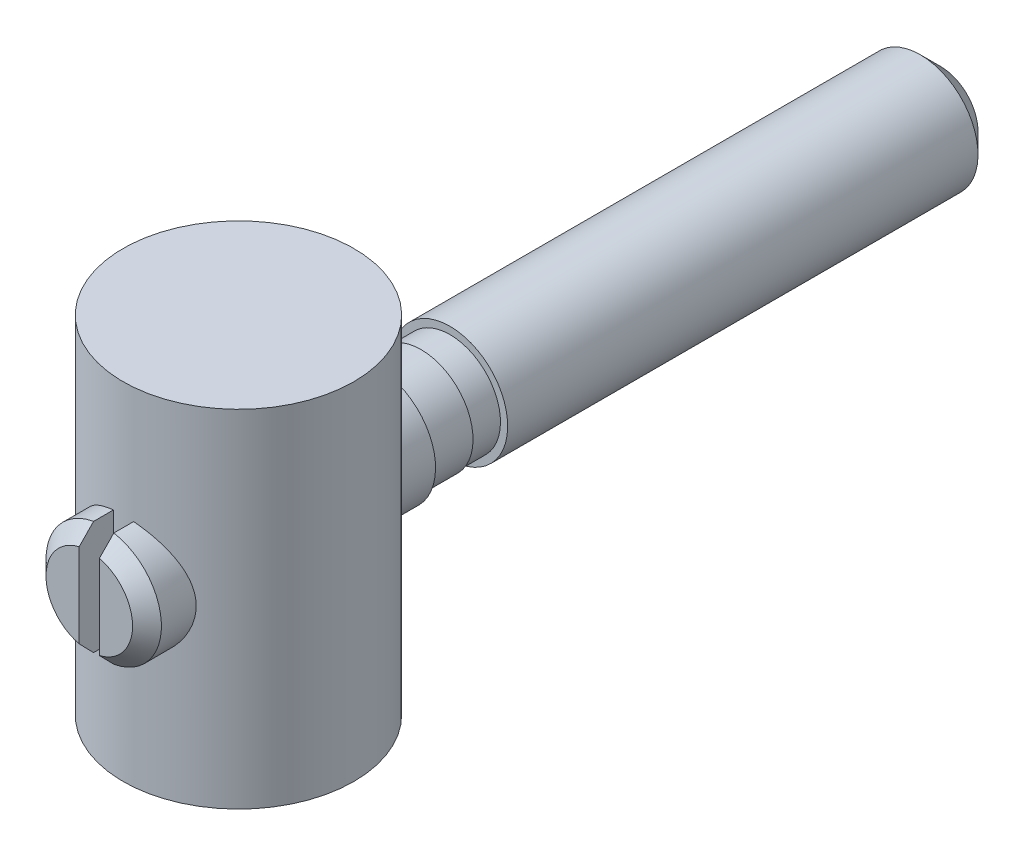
ISO-10303-21;
HEADER;
FILE_DESCRIPTION(('STEP AP214'),'2;1');
FILE_NAME('part.step','',(''),(''),'','','');
FILE_SCHEMA(('AUTOMOTIVE_DESIGN { 1 0 10303 214 1 1 1 1 }'));
ENDSEC;
DATA;
#1=APPLICATION_CONTEXT('core data for automotive mechanical design processes');
#2=APPLICATION_PROTOCOL_DEFINITION('international standard','automotive_design',2000,#1);
#3=PRODUCT_CONTEXT('',#1,'mechanical');
#4=PRODUCT('Part','Part','',(#3));
#5=PRODUCT_RELATED_PRODUCT_CATEGORY('part','',(#4));
#6=PRODUCT_DEFINITION_FORMATION('','',#4);
#7=PRODUCT_DEFINITION_CONTEXT('part definition',#1,'design');
#8=PRODUCT_DEFINITION('design','',#6,#7);
#9=PRODUCT_DEFINITION_SHAPE('','',#8);
#10=(LENGTH_UNIT() NAMED_UNIT(*) SI_UNIT(.MILLI.,.METRE.));
#11=(NAMED_UNIT(*) PLANE_ANGLE_UNIT() SI_UNIT($,.RADIAN.));
#12=(NAMED_UNIT(*) SI_UNIT($,.STERADIAN.) SOLID_ANGLE_UNIT());
#13=UNCERTAINTY_MEASURE_WITH_UNIT(LENGTH_MEASURE(1.E-05),#10,'distance_accuracy_value','');
#14=(GEOMETRIC_REPRESENTATION_CONTEXT(3) GLOBAL_UNCERTAINTY_ASSIGNED_CONTEXT((#13)) GLOBAL_UNIT_ASSIGNED_CONTEXT((#10,
#11,#12)) REPRESENTATION_CONTEXT('',''));
#15=CARTESIAN_POINT('',(0.,0.,0.));
#16=DIRECTION('',(0.,0.,1.));
#17=DIRECTION('',(1.,0.,0.));
#18=AXIS2_PLACEMENT_3D('',#15,#16,#17);
#19=CARTESIAN_POINT('',(0.,-6.,0.));
#20=DIRECTION('',(0.,-1.,0.));
#21=DIRECTION('',(1.,0.,0.));
#22=AXIS2_PLACEMENT_3D('',#19,#20,#21);
#23=PLANE('',#22);
#24=DIRECTION('',(0.5,0.,-0.866025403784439));
#25=VECTOR('',#24,1.);
#26=CARTESIAN_POINT('',(0.86602540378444,-6.,0.));
#27=LINE('',#26,#25);
#28=CARTESIAN_POINT('',(0.43301270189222,-6.,0.750000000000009));
#29=VERTEX_POINT('',#28);
#30=CARTESIAN_POINT('',(0.86602540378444,-6.,0.));
#31=VERTEX_POINT('',#30);
#32=EDGE_CURVE('E94',#29,#31,#27,.T.);
#33=ORIENTED_EDGE('',*,*,#32,.F.);
#34=DIRECTION('',(1.,0.,0.));
#35=VECTOR('',#34,1.);
#36=CARTESIAN_POINT('',(0.43301270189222,-6.,0.750000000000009));
#37=LINE('',#36,#35);
#38=CARTESIAN_POINT('',(-0.433012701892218,-6.,0.750000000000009));
#39=VERTEX_POINT('',#38);
#40=EDGE_CURVE('E92',#39,#29,#37,.T.);
#41=ORIENTED_EDGE('',*,*,#40,.F.);
#42=DIRECTION('',(0.5,0.,0.866025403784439));
#43=VECTOR('',#42,1.);
#44=CARTESIAN_POINT('',(-0.433012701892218,-6.,0.750000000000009));
#45=LINE('',#44,#43);
#46=CARTESIAN_POINT('',(-0.866025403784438,-6.,0.));
#47=VERTEX_POINT('',#46);
#48=EDGE_CURVE('E524',#47,#39,#45,.T.);
#49=ORIENTED_EDGE('',*,*,#48,.F.);
#50=DIRECTION('',(-0.5,0.,0.866025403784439));
#51=VECTOR('',#50,1.);
#52=CARTESIAN_POINT('',(-0.866025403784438,-6.,0.));
#53=LINE('',#52,#51);
#54=CARTESIAN_POINT('',(-0.433012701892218,-6.,-0.75));
#55=VERTEX_POINT('',#54);
#56=EDGE_CURVE('E574',#55,#47,#53,.T.);
#57=ORIENTED_EDGE('',*,*,#56,.F.);
#58=DIRECTION('',(-1.,0.,0.));
#59=VECTOR('',#58,1.);
#60=CARTESIAN_POINT('',(-0.433012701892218,-6.,-0.75));
#61=LINE('',#60,#59);
#62=CARTESIAN_POINT('',(0.433012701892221,-6.,-0.75));
#63=VERTEX_POINT('',#62);
#64=EDGE_CURVE('E535',#63,#55,#61,.T.);
#65=ORIENTED_EDGE('',*,*,#64,.F.);
#66=DIRECTION('',(-0.5,0.,-0.866025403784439));
#67=VECTOR('',#66,1.);
#68=CARTESIAN_POINT('',(0.433012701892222,-6.,-0.75));
#69=LINE('',#68,#67);
#70=EDGE_CURVE('E522',#31,#63,#69,.T.);
#71=ORIENTED_EDGE('',*,*,#70,.F.);
#72=EDGE_LOOP('',(#33,#41,#49,#57,#65,#71));
#73=FACE_BOUND('',#72,.T.);
#74=ADVANCED_FACE('F14',(#73),#23,.T.);
#75=CARTESIAN_POINT('',(0.433012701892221,-5.8,-0.75));
#76=DIRECTION('',(0.866025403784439,0.,-0.5));
#77=DIRECTION('',(-0.5,0.,-0.866025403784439));
#78=AXIS2_PLACEMENT_3D('',#75,#76,#77);
#79=PLANE('',#78);
#80=DIRECTION('',(0.,1.,0.));
#81=VECTOR('',#80,1.);
#82=CARTESIAN_POINT('',(0.86602540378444,-5.8,0.));
#83=LINE('',#82,#81);
#84=CARTESIAN_POINT('',(0.86602540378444,-7.,0.));
#85=VERTEX_POINT('',#84);
#86=EDGE_CURVE('E80',#31,#85,#83,.F.);
#87=ORIENTED_EDGE('',*,*,#86,.F.);
#88=ORIENTED_EDGE('',*,*,#70,.T.);
#89=DIRECTION('',(0.,1.,0.));
#90=VECTOR('',#89,1.);
#91=CARTESIAN_POINT('',(0.433012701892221,-5.8,-0.75));
#92=LINE('',#91,#90);
#93=CARTESIAN_POINT('',(0.433012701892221,-7.,-0.75));
#94=VERTEX_POINT('',#93);
#95=EDGE_CURVE('E107',#94,#63,#92,.T.);
#96=ORIENTED_EDGE('',*,*,#95,.F.);
#97=DIRECTION('',(0.5,0.,0.866025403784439));
#98=VECTOR('',#97,1.);
#99=CARTESIAN_POINT('',(0.433012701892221,-7.,-0.75));
#100=LINE('',#99,#98);
#101=EDGE_CURVE('E130',#94,#85,#100,.T.);
#102=ORIENTED_EDGE('',*,*,#101,.T.);
#103=EDGE_LOOP('',(#87,#88,#96,#102));
#104=FACE_BOUND('',#103,.T.);
#105=ADVANCED_FACE('F165',(#104),#79,.F.);
#106=CARTESIAN_POINT('',(0.86602540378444,-5.8,0.));
#107=DIRECTION('',(0.866025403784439,0.,0.5));
#108=DIRECTION('',(0.5,0.,-0.866025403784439));
#109=AXIS2_PLACEMENT_3D('',#106,#107,#108);
#110=PLANE('',#109);
#111=DIRECTION('',(0.,1.,0.));
#112=VECTOR('',#111,1.);
#113=CARTESIAN_POINT('',(0.43301270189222,-5.8,0.750000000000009));
#114=LINE('',#113,#112);
#115=CARTESIAN_POINT('',(0.43301270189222,-7.,0.750000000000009));
#116=VERTEX_POINT('',#115);
#117=EDGE_CURVE('E78',#116,#29,#114,.T.);
#118=ORIENTED_EDGE('',*,*,#117,.T.);
#119=ORIENTED_EDGE('',*,*,#32,.T.);
#120=ORIENTED_EDGE('',*,*,#86,.T.);
#121=DIRECTION('',(-0.5,0.,0.866025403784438));
#122=VECTOR('',#121,1.);
#123=CARTESIAN_POINT('',(0.86602540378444,-7.,0.));
#124=LINE('',#123,#122);
#125=EDGE_CURVE('E75',#85,#116,#124,.T.);
#126=ORIENTED_EDGE('',*,*,#125,.T.);
#127=EDGE_LOOP('',(#118,#119,#120,#126));
#128=FACE_BOUND('',#127,.T.);
#129=ADVANCED_FACE('F16',(#128),#110,.F.);
#130=CARTESIAN_POINT('',(0.43301270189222,-5.8,0.750000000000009));
#131=DIRECTION('',(0.,0.,1.));
#132=DIRECTION('',(1.,0.,0.));
#133=AXIS2_PLACEMENT_3D('',#130,#131,#132);
#134=PLANE('',#133);
#135=DIRECTION('',(0.,1.,0.));
#136=VECTOR('',#135,1.);
#137=CARTESIAN_POINT('',(-0.433012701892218,-5.8,0.750000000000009));
#138=LINE('',#137,#136);
#139=CARTESIAN_POINT('',(-0.433012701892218,-7.,0.750000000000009));
#140=VERTEX_POINT('',#139);
#141=EDGE_CURVE('E93',#140,#39,#138,.T.);
#142=ORIENTED_EDGE('',*,*,#141,.T.);
#143=ORIENTED_EDGE('',*,*,#40,.T.);
#144=ORIENTED_EDGE('',*,*,#117,.F.);
#145=DIRECTION('',(-1.,0.,0.));
#146=VECTOR('',#145,1.);
#147=CARTESIAN_POINT('',(0.,-7.,0.750000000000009));
#148=LINE('',#147,#146);
#149=EDGE_CURVE('E85',#116,#140,#148,.T.);
#150=ORIENTED_EDGE('',*,*,#149,.T.);
#151=EDGE_LOOP('',(#142,#143,#144,#150));
#152=FACE_BOUND('',#151,.T.);
#153=ADVANCED_FACE('F90',(#152),#134,.F.);
#154=CARTESIAN_POINT('',(-0.433012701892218,-5.8,0.750000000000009));
#155=DIRECTION('',(-0.866025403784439,0.,0.5));
#156=DIRECTION('',(0.5,0.,0.866025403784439));
#157=AXIS2_PLACEMENT_3D('',#154,#155,#156);
#158=PLANE('',#157);
#159=DIRECTION('',(0.,1.,0.));
#160=VECTOR('',#159,1.);
#161=CARTESIAN_POINT('',(-0.866025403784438,-5.8,0.));
#162=LINE('',#161,#160);
#163=CARTESIAN_POINT('',(-0.866025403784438,-7.,0.));
#164=VERTEX_POINT('',#163);
#165=EDGE_CURVE('E113',#164,#47,#162,.T.);
#166=ORIENTED_EDGE('',*,*,#165,.T.);
#167=ORIENTED_EDGE('',*,*,#48,.T.);
#168=ORIENTED_EDGE('',*,*,#141,.F.);
#169=DIRECTION('',(-0.5,0.,-0.866025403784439));
#170=VECTOR('',#169,1.);
#171=CARTESIAN_POINT('',(-0.433012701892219,-7.,0.750000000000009));
#172=LINE('',#171,#170);
#173=EDGE_CURVE('E100',#140,#164,#172,.T.);
#174=ORIENTED_EDGE('',*,*,#173,.T.);
#175=EDGE_LOOP('',(#166,#167,#168,#174));
#176=FACE_BOUND('',#175,.T.);
#177=ADVANCED_FACE('F175',(#176),#158,.F.);
#178=CARTESIAN_POINT('',(-0.866025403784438,-5.8,0.));
#179=DIRECTION('',(-0.866025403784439,0.,-0.5));
#180=DIRECTION('',(-0.5,0.,0.866025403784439));
#181=AXIS2_PLACEMENT_3D('',#178,#179,#180);
#182=PLANE('',#181);
#183=DIRECTION('',(0.,1.,0.));
#184=VECTOR('',#183,1.);
#185=CARTESIAN_POINT('',(-0.433012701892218,-5.8,-0.75));
#186=LINE('',#185,#184);
#187=CARTESIAN_POINT('',(-0.433012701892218,-7.,-0.75));
#188=VERTEX_POINT('',#187);
#189=EDGE_CURVE('E110',#188,#55,#186,.T.);
#190=ORIENTED_EDGE('',*,*,#189,.T.);
#191=ORIENTED_EDGE('',*,*,#56,.T.);
#192=ORIENTED_EDGE('',*,*,#165,.F.);
#193=DIRECTION('',(0.5,0.,-0.866025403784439));
#194=VECTOR('',#193,1.);
#195=CARTESIAN_POINT('',(-0.866025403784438,-7.,0.));
#196=LINE('',#195,#194);
#197=EDGE_CURVE('E102',#164,#188,#196,.T.);
#198=ORIENTED_EDGE('',*,*,#197,.T.);
#199=EDGE_LOOP('',(#190,#191,#192,#198));
#200=FACE_BOUND('',#199,.T.);
#201=ADVANCED_FACE('F171',(#200),#182,.F.);
#202=CARTESIAN_POINT('',(-0.433012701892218,-5.8,-0.75));
#203=DIRECTION('',(0.,0.,-1.));
#204=DIRECTION('',(-1.,0.,0.));
#205=AXIS2_PLACEMENT_3D('',#202,#203,#204);
#206=PLANE('',#205);
#207=ORIENTED_EDGE('',*,*,#95,.T.);
#208=ORIENTED_EDGE('',*,*,#64,.T.);
#209=ORIENTED_EDGE('',*,*,#189,.F.);
#210=DIRECTION('',(-1.,0.,0.));
#211=VECTOR('',#210,1.);
#212=CARTESIAN_POINT('',(0.,-7.,-0.75));
#213=LINE('',#212,#211);
#214=EDGE_CURVE('E529',#188,#94,#213,.F.);
#215=ORIENTED_EDGE('',*,*,#214,.T.);
#216=EDGE_LOOP('',(#207,#208,#209,#215));
#217=FACE_BOUND('',#216,.T.);
#218=ADVANCED_FACE('F163',(#217),#206,.F.);
#219=CARTESIAN_POINT('',(0.,-7.,0.));
#220=DIRECTION('',(0.,1.,0.));
#221=DIRECTION('',(-1.,0.,0.));
#222=AXIS2_PLACEMENT_3D('',#219,#220,#221);
#223=PLANE('',#222);
#224=CARTESIAN_POINT('',(0.,-7.,0.));
#225=DIRECTION('',(0.,1.,0.));
#226=DIRECTION('',(-1.,0.,0.));
#227=AXIS2_PLACEMENT_3D('',#224,#225,#226);
#228=CIRCLE('',#227,1.5);
#229=CARTESIAN_POINT('',(-1.5,-7.,0.));
#230=VERTEX_POINT('',#229);
#231=EDGE_CURVE('E127',#230,#230,#228,.T.);
#232=ORIENTED_EDGE('',*,*,#231,.F.);
#233=EDGE_LOOP('',(#232));
#234=FACE_BOUND('',#233,.T.);
#235=ORIENTED_EDGE('',*,*,#214,.F.);
#236=ORIENTED_EDGE('',*,*,#197,.F.);
#237=ORIENTED_EDGE('',*,*,#173,.F.);
#238=ORIENTED_EDGE('',*,*,#149,.F.);
#239=ORIENTED_EDGE('',*,*,#125,.F.);
#240=ORIENTED_EDGE('',*,*,#101,.F.);
#241=EDGE_LOOP('',(#235,#236,#237,#238,#239,#240));
#242=FACE_BOUND('',#241,.T.);
#243=ADVANCED_FACE('F98',(#234,#242),#223,.F.);
#244=CARTESIAN_POINT('',(0.,-4.,0.));
#245=DIRECTION('',(0.,1.,0.));
#246=DIRECTION('',(-1.,0.,0.));
#247=AXIS2_PLACEMENT_3D('',#244,#245,#246);
#248=CYLINDRICAL_SURFACE('',#247,1.5);
#249=ORIENTED_EDGE('',*,*,#231,.T.);
#250=EDGE_LOOP('',(#249));
#251=FACE_BOUND('',#250,.T.);
#252=CARTESIAN_POINT('',(0.,-6.,0.));
#253=DIRECTION('',(0.,1.,0.));
#254=DIRECTION('',(-1.,0.,0.));
#255=AXIS2_PLACEMENT_3D('',#252,#253,#254);
#256=CIRCLE('',#255,1.5);
#257=CARTESIAN_POINT('',(-1.5,-6.,0.));
#258=VERTEX_POINT('',#257);
#259=EDGE_CURVE('E124',#258,#258,#256,.F.);
#260=ORIENTED_EDGE('',*,*,#259,.T.);
#261=EDGE_LOOP('',(#260));
#262=FACE_BOUND('',#261,.T.);
#263=ADVANCED_FACE('F156',(#251,#262),#248,.T.);
#264=CARTESIAN_POINT('',(0.,6.,0.));
#265=DIRECTION('',(0.,1.,0.));
#266=DIRECTION('',(-1.,0.,0.));
#267=AXIS2_PLACEMENT_3D('',#264,#265,#266);
#268=PLANE('',#267);
#269=CARTESIAN_POINT('',(0.,6.,0.));
#270=DIRECTION('',(0.,-1.,0.));
#271=DIRECTION('',(1.,0.,0.));
#272=AXIS2_PLACEMENT_3D('',#269,#270,#271);
#273=CIRCLE('',#272,4.);
#274=CARTESIAN_POINT('',(4.,6.,0.));
#275=VERTEX_POINT('',#274);
#276=EDGE_CURVE('E121',#275,#275,#273,.T.);
#277=ORIENTED_EDGE('',*,*,#276,.F.);
#278=EDGE_LOOP('',(#277));
#279=FACE_BOUND('',#278,.T.);
#280=ADVANCED_FACE('F152',(#279),#268,.T.);
#281=CARTESIAN_POINT('',(0.,-6.,0.));
#282=DIRECTION('',(0.,1.,0.));
#283=DIRECTION('',(-1.,0.,0.));
#284=AXIS2_PLACEMENT_3D('',#281,#282,#283);
#285=PLANE('',#284);
#286=ORIENTED_EDGE('',*,*,#259,.F.);
#287=EDGE_LOOP('',(#286));
#288=FACE_BOUND('',#287,.T.);
#289=CARTESIAN_POINT('',(0.,-6.,0.));
#290=DIRECTION('',(0.,-1.,0.));
#291=DIRECTION('',(1.,0.,0.));
#292=AXIS2_PLACEMENT_3D('',#289,#290,#291);
#293=CIRCLE('',#292,4.);
#294=CARTESIAN_POINT('',(4.,-6.,0.));
#295=VERTEX_POINT('',#294);
#296=EDGE_CURVE('E117',#295,#295,#293,.F.);
#297=ORIENTED_EDGE('',*,*,#296,.F.);
#298=EDGE_LOOP('',(#297));
#299=FACE_BOUND('',#298,.T.);
#300=ADVANCED_FACE('F146',(#288,#299),#285,.F.);
#301=CARTESIAN_POINT('',(0.,6.,0.));
#302=DIRECTION('',(0.,-1.,0.));
#303=DIRECTION('',(1.,0.,0.));
#304=AXIS2_PLACEMENT_3D('',#301,#302,#303);
#305=CYLINDRICAL_SURFACE('',#304,4.);
#306=CARTESIAN_POINT('',(0.,2.,4.));
#307=CARTESIAN_POINT('',(-0.105143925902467,1.99999339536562,3.99999426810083));
#308=CARTESIAN_POINT('',(-0.210413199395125,1.99165985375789,3.99580982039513));
#309=CARTESIAN_POINT('',(-0.417840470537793,1.95869423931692,3.97948312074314));
#310=CARTESIAN_POINT('',(-0.519992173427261,1.93403121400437,3.9673257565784));
#311=CARTESIAN_POINT('',(-0.7178670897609,1.86961238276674,3.93632558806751));
#312=CARTESIAN_POINT('',(-0.813613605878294,1.82991523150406,3.91750878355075));
#313=CARTESIAN_POINT('',(-0.996945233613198,1.73685875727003,3.87491553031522));
#314=CARTESIAN_POINT('',(-1.08453098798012,1.68350051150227,3.8511394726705));
#315=CARTESIAN_POINT('',(-1.25501563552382,1.56096550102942,3.79912516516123));
#316=CARTESIAN_POINT('',(-1.33731042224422,1.49102704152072,3.77070398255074));
#317=CARTESIAN_POINT('',(-1.48955888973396,1.33895704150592,3.71319940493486));
#318=CARTESIAN_POINT('',(-1.55950316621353,1.25681629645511,3.68411552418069));
#319=CARTESIAN_POINT('',(-1.69050400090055,1.07503330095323,3.62597902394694));
#320=CARTESIAN_POINT('',(-1.75045067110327,0.97452780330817,3.59710373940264));
#321=CARTESIAN_POINT('',(-1.85233645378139,0.763265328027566,3.54571957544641));
#322=CARTESIAN_POINT('',(-1.89428842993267,0.652515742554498,3.52320615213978));
#323=CARTESIAN_POINT('',(-1.95626488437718,0.430669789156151,3.48915734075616));
#324=CARTESIAN_POINT('',(-1.97745171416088,0.319991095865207,3.47704543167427));
#325=CARTESIAN_POINT('',(-2.00085398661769,0.0960423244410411,3.46363779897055));
#326=CARTESIAN_POINT('',(-2.00308817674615,-0.0172250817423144,3.46233138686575));
#327=CARTESIAN_POINT('',(-1.98937457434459,-0.228572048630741,3.47021860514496));
#328=CARTESIAN_POINT('',(-1.97556911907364,-0.326848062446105,3.47817527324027));
#329=CARTESIAN_POINT('',(-1.93387969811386,-0.519443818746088,3.50152457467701));
#330=CARTESIAN_POINT('',(-1.9059912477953,-0.613762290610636,3.51691957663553));
#331=CARTESIAN_POINT('',(-1.83641956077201,-0.798458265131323,3.55374952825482));
#332=CARTESIAN_POINT('',(-1.79443013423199,-0.888692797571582,3.57531681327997));
#333=CARTESIAN_POINT('',(-1.69808337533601,-1.06126858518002,3.62206808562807));
#334=CARTESIAN_POINT('',(-1.64372048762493,-1.14360627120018,3.64725369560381));
#335=CARTESIAN_POINT('',(-1.51613210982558,-1.30904250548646,3.70226315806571));
#336=CARTESIAN_POINT('',(-1.44138891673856,-1.39091374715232,3.73227020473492));
#337=CARTESIAN_POINT('',(-1.27911115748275,-1.54147083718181,3.79095246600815));
#338=CARTESIAN_POINT('',(-1.19157051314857,-1.61015038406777,3.81962703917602));
#339=CARTESIAN_POINT('',(-1.0010330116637,-1.73537132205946,3.87403974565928));
#340=CARTESIAN_POINT('',(-0.897507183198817,-1.79120094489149,3.89957968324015));
#341=CARTESIAN_POINT('',(-0.680932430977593,-1.88419405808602,3.94315762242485));
#342=CARTESIAN_POINT('',(-0.567891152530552,-1.92137237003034,3.96120157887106));
#343=CARTESIAN_POINT('',(-0.345532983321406,-1.97295080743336,3.98648667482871));
#344=CARTESIAN_POINT('',(-0.236683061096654,-1.98898247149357,3.9944987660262));
#345=CARTESIAN_POINT('',(-0.0175591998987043,-2.00292946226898,4.00146026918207));
#346=CARTESIAN_POINT('',(0.0927140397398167,-2.00085337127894,4.00041397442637));
#347=CARTESIAN_POINT('',(0.302465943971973,-1.97958662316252,3.98982384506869));
#348=CARTESIAN_POINT('',(0.402118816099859,-1.96173493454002,3.98094491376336));
#349=CARTESIAN_POINT('',(0.596813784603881,-1.91152385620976,3.95644342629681));
#350=CARTESIAN_POINT('',(0.691855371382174,-1.87916286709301,3.94082012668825));
#351=CARTESIAN_POINT('',(0.877777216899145,-1.80000306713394,3.90368502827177));
#352=CARTESIAN_POINT('',(0.968460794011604,-1.75281789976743,3.88201763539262));
#353=CARTESIAN_POINT('',(1.14092272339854,-1.64578492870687,3.83487948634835));
#354=CARTESIAN_POINT('',(1.22269725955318,-1.58593173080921,3.80940711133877));
#355=CARTESIAN_POINT('',(1.38353537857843,-1.44847914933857,3.75416442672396));
#356=CARTESIAN_POINT('',(1.46154415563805,-1.36971426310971,3.72421769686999));
#357=CARTESIAN_POINT('',(1.60371264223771,-1.20014969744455,3.66524783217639));
#358=CARTESIAN_POINT('',(1.66786277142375,-1.10934176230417,3.63622534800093));
#359=CARTESIAN_POINT('',(1.78341582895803,-0.912712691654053,3.58102384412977));
#360=CARTESIAN_POINT('',(1.8340509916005,-0.806377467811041,3.55505059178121));
#361=CARTESIAN_POINT('',(1.91616565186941,-0.584979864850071,3.5114814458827));
#362=CARTESIAN_POINT('',(1.94766983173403,-0.469928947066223,3.493874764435));
#363=CARTESIAN_POINT('',(1.98772337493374,-0.246179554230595,3.47123002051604));
#364=CARTESIAN_POINT('',(1.9981859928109,-0.13793149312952,3.4651476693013));
#365=CARTESIAN_POINT('',(2.0013783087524,0.0788941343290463,3.46330709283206));
#366=CARTESIAN_POINT('',(1.99411569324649,0.18747153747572,3.46754439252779));
#367=CARTESIAN_POINT('',(1.96385225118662,0.39096700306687,3.48475724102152));
#368=CARTESIAN_POINT('',(1.94241662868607,0.486200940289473,3.49686188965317));
#369=CARTESIAN_POINT('',(1.88635071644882,0.671616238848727,3.52742032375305));
#370=CARTESIAN_POINT('',(1.85171618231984,0.761795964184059,3.54587615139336));
#371=CARTESIAN_POINT('',(1.76763149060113,0.94124970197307,3.5885706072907));
#372=CARTESIAN_POINT('',(1.7173422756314,1.03005580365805,3.61311444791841));
#373=CARTESIAN_POINT('',(1.60430194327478,1.19854907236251,3.66470663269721));
#374=CARTESIAN_POINT('',(1.54154434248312,1.27823146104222,3.69175627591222));
#375=CARTESIAN_POINT('',(1.39640665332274,1.43628396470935,3.74924646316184));
#376=CARTESIAN_POINT('',(1.31256884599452,1.51331820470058,3.77969966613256));
#377=CARTESIAN_POINT('',(1.13230961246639,1.65252596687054,3.83755504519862));
#378=CARTESIAN_POINT('',(1.03588144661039,1.71469147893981,3.86495557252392));
#379=CARTESIAN_POINT('',(0.831863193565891,1.82247272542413,3.91396019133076));
#380=CARTESIAN_POINT('',(0.724199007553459,1.86796833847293,3.93552192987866));
#381=CARTESIAN_POINT('',(0.501484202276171,1.93961633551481,3.97002682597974));
#382=CARTESIAN_POINT('',(0.3864555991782,1.96582369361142,3.98299446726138));
#383=CARTESIAN_POINT('',(0.22520389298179,1.98779482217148,3.99390923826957));
#384=CARTESIAN_POINT('',(0.180323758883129,1.99236528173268,3.99618730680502));
#385=CARTESIAN_POINT('',(0.0903034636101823,1.99846933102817,3.99923393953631));
#386=CARTESIAN_POINT('',(0.0451632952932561,2.00000283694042,4.00000246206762));
#387=CARTESIAN_POINT('',(0.,2.,4.));
#388=B_SPLINE_CURVE_WITH_KNOTS('',3,(#306,#307,#308,#309,#310,#311,#312,#313,#314,#315,#316,
#317,#318,#319,#320,#321,#322,#323,#324,#325,#326,#327,#328,#329,#330,#331,#332,#333,#334,#335,
#336,#337,#338,#339,#340,#341,#342,#343,#344,#345,#346,#347,#348,#349,#350,#351,#352,#353,#354,
#355,#356,#357,#358,#359,#360,#361,#362,#363,#364,#365,#366,#367,#368,#369,#370,#371,#372,#373,
#374,#375,#376,#377,#378,#379,#380,#381,#382,#383,#384,#385,#386,#387),.UNSPECIFIED.,.T.,.F.,(4,
2,2,2,2,2,2,2,2,2,2,2,2,2,2,2,2,2,2,2,2,2,2,2,2,2,2,2,2,2,2,2,2,2,2,2,2,2,2,2,4),(0.,
0.315248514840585,0.631096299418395,0.945724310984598,1.26032752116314,1.59396351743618,
1.92785247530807,2.28763452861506,2.64715895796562,2.98516024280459,3.32282714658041,
3.62011424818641,3.91749607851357,4.22180480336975,4.52625042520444,4.86929882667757,
5.21251069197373,5.57166044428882,5.93052433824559,6.25966580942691,6.58865129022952,
6.89213813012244,7.19565843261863,7.50785712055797,7.82018901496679,8.16319221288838,
8.50643177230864,8.86629364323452,9.22569023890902,9.55058615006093,9.87534119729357,
10.1691586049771,10.463070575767,10.7767291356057,11.0905512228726,11.4425048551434,
11.7946476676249,12.1492802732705,12.502898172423,12.6383056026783,12.7737167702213),.UNSPECIFIED.);
#389=CARTESIAN_POINT('',(0.35,-1.96913686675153,3.98465807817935));
#390=VERTEX_POINT('',#389);
#391=CARTESIAN_POINT('',(0.35,1.96913686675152,3.98465807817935));
#392=VERTEX_POINT('',#391);
#393=EDGE_CURVE('E35',#390,#392,#388,.T.);
#394=ORIENTED_EDGE('',*,*,#393,.F.);
#395=DIRECTION('',(0.,-1.,0.));
#396=VECTOR('',#395,1.);
#397=CARTESIAN_POINT('',(0.35,6.,3.98465807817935));
#398=LINE('',#397,#396);
#399=EDGE_CURVE('E135',#392,#390,#398,.T.);
#400=ORIENTED_EDGE('',*,*,#399,.F.);
#401=EDGE_LOOP('',(#394,#400));
#402=FACE_BOUND('',#401,.T.);
#403=ORIENTED_EDGE('',*,*,#296,.T.);
#404=EDGE_LOOP('',(#403));
#405=FACE_BOUND('',#404,.T.);
#406=ORIENTED_EDGE('',*,*,#276,.T.);
#407=EDGE_LOOP('',(#406));
#408=FACE_BOUND('',#407,.T.);
#409=CARTESIAN_POINT('',(-0.35,1.96913686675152,3.98465807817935));
#410=VERTEX_POINT('',#409);
#411=CARTESIAN_POINT('',(-0.35,-1.96913686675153,3.98465807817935));
#412=VERTEX_POINT('',#411);
#413=EDGE_CURVE('E28',#410,#412,#388,.T.);
#414=ORIENTED_EDGE('',*,*,#413,.F.);
#415=DIRECTION('',(0.,-1.,0.));
#416=VECTOR('',#415,1.);
#417=CARTESIAN_POINT('',(-0.35,6.,3.98465807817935));
#418=LINE('',#417,#416);
#419=EDGE_CURVE('E559',#412,#410,#418,.F.);
#420=ORIENTED_EDGE('',*,*,#419,.F.);
#421=EDGE_LOOP('',(#414,#420));
#422=FACE_BOUND('',#421,.T.);
#423=CARTESIAN_POINT('',(0.,2.,-4.));
#424=CARTESIAN_POINT('',(0.105143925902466,1.99999339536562,-3.99999426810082));
#425=CARTESIAN_POINT('',(0.210413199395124,1.99165985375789,-3.99580982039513));
#426=CARTESIAN_POINT('',(0.417840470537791,1.95869423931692,-3.97948312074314));
#427=CARTESIAN_POINT('',(0.519992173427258,1.93403121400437,-3.96732575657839));
#428=CARTESIAN_POINT('',(0.717867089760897,1.86961238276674,-3.9363255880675));
#429=CARTESIAN_POINT('',(0.813613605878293,1.82991523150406,-3.91750878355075));
#430=CARTESIAN_POINT('',(0.996945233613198,1.73685875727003,-3.87491553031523));
#431=CARTESIAN_POINT('',(1.08453098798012,1.68350051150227,-3.85113947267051));
#432=CARTESIAN_POINT('',(1.25501563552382,1.56096550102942,-3.79912516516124));
#433=CARTESIAN_POINT('',(1.33731042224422,1.49102704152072,-3.77070398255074));
#434=CARTESIAN_POINT('',(1.48955888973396,1.33895704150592,-3.71319940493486));
#435=CARTESIAN_POINT('',(1.55950316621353,1.25681629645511,-3.68411552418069));
#436=CARTESIAN_POINT('',(1.69050400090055,1.07503330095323,-3.62597902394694));
#437=CARTESIAN_POINT('',(1.75045067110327,0.97452780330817,-3.59710373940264));
#438=CARTESIAN_POINT('',(1.85233645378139,0.763265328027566,-3.54571957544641));
#439=CARTESIAN_POINT('',(1.89428842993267,0.652515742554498,-3.52320615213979));
#440=CARTESIAN_POINT('',(1.95626488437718,0.430669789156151,-3.48915734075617));
#441=CARTESIAN_POINT('',(1.97745171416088,0.319991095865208,-3.47704543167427));
#442=CARTESIAN_POINT('',(2.00085398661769,0.0960423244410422,-3.46363779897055));
#443=CARTESIAN_POINT('',(2.00308817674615,-0.0172250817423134,-3.46233138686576));
#444=CARTESIAN_POINT('',(1.98937457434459,-0.22857204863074,-3.47021860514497));
#445=CARTESIAN_POINT('',(1.97556911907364,-0.326848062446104,-3.47817527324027));
#446=CARTESIAN_POINT('',(1.93387969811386,-0.519443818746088,-3.50152457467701));
#447=CARTESIAN_POINT('',(1.9059912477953,-0.613762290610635,-3.51691957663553));
#448=CARTESIAN_POINT('',(1.83641956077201,-0.798458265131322,-3.55374952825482));
#449=CARTESIAN_POINT('',(1.79443013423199,-0.888692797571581,-3.57531681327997));
#450=CARTESIAN_POINT('',(1.698083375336,-1.06126858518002,-3.62206808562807));
#451=CARTESIAN_POINT('',(1.64372048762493,-1.14360627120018,-3.64725369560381));
#452=CARTESIAN_POINT('',(1.51613210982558,-1.30904250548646,-3.70226315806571));
#453=CARTESIAN_POINT('',(1.44138891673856,-1.39091374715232,-3.73227020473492));
#454=CARTESIAN_POINT('',(1.27911115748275,-1.54147083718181,-3.79095246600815));
#455=CARTESIAN_POINT('',(1.19157051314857,-1.61015038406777,-3.81962703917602));
#456=CARTESIAN_POINT('',(1.0010330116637,-1.73537132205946,-3.87403974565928));
#457=CARTESIAN_POINT('',(0.897507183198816,-1.79120094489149,-3.89957968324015));
#458=CARTESIAN_POINT('',(0.680932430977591,-1.88419405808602,-3.94315762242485));
#459=CARTESIAN_POINT('',(0.56789115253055,-1.92137237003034,-3.96120157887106));
#460=CARTESIAN_POINT('',(0.345532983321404,-1.97295080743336,-3.98648667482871));
#461=CARTESIAN_POINT('',(0.236683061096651,-1.98898247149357,-3.9944987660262));
#462=CARTESIAN_POINT('',(0.0175591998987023,-2.00292946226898,-4.00146026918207));
#463=CARTESIAN_POINT('',(-0.0927140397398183,-2.00085337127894,-4.00041397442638));
#464=CARTESIAN_POINT('',(-0.302465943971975,-1.97958662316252,-3.9898238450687));
#465=CARTESIAN_POINT('',(-0.402118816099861,-1.96173493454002,-3.98094491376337));
#466=CARTESIAN_POINT('',(-0.596813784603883,-1.91152385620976,-3.95644342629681));
#467=CARTESIAN_POINT('',(-0.691855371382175,-1.87916286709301,-3.94082012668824));
#468=CARTESIAN_POINT('',(-0.877777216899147,-1.80000306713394,-3.90368502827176));
#469=CARTESIAN_POINT('',(-0.968460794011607,-1.75281789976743,-3.88201763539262));
#470=CARTESIAN_POINT('',(-1.14092272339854,-1.64578492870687,-3.83487948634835));
#471=CARTESIAN_POINT('',(-1.22269725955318,-1.58593173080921,-3.80940711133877));
#472=CARTESIAN_POINT('',(-1.38353537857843,-1.44847914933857,-3.75416442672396));
#473=CARTESIAN_POINT('',(-1.46154415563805,-1.36971426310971,-3.72421769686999));
#474=CARTESIAN_POINT('',(-1.60371264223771,-1.20014969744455,-3.6652478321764));
#475=CARTESIAN_POINT('',(-1.66786277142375,-1.10934176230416,-3.63622534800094));
#476=CARTESIAN_POINT('',(-1.78341582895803,-0.912712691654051,-3.58102384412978));
#477=CARTESIAN_POINT('',(-1.8340509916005,-0.80637746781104,-3.55505059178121));
#478=CARTESIAN_POINT('',(-1.91616565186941,-0.584979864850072,-3.5114814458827));
#479=CARTESIAN_POINT('',(-1.94766983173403,-0.469928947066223,-3.493874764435));
#480=CARTESIAN_POINT('',(-1.98772337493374,-0.246179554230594,-3.47123002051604));
#481=CARTESIAN_POINT('',(-1.9981859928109,-0.137931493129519,-3.4651476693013));
#482=CARTESIAN_POINT('',(-2.00137830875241,0.0788941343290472,-3.46330709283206));
#483=CARTESIAN_POINT('',(-1.99411569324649,0.18747153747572,-3.4675443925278));
#484=CARTESIAN_POINT('',(-1.96385225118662,0.390967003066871,-3.48475724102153));
#485=CARTESIAN_POINT('',(-1.94241662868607,0.486200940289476,-3.49686188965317));
#486=CARTESIAN_POINT('',(-1.88635071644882,0.67161623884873,-3.52742032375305));
#487=CARTESIAN_POINT('',(-1.85171618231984,0.761795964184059,-3.54587615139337));
#488=CARTESIAN_POINT('',(-1.76763149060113,0.94124970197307,-3.58857060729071));
#489=CARTESIAN_POINT('',(-1.7173422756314,1.03005580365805,-3.61311444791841));
#490=CARTESIAN_POINT('',(-1.60430194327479,1.19854907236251,-3.66470663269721));
#491=CARTESIAN_POINT('',(-1.54154434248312,1.27823146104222,-3.69175627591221));
#492=CARTESIAN_POINT('',(-1.39640665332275,1.43628396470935,-3.74924646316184));
#493=CARTESIAN_POINT('',(-1.31256884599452,1.51331820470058,-3.77969966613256));
#494=CARTESIAN_POINT('',(-1.13230961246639,1.65252596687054,-3.83755504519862));
#495=CARTESIAN_POINT('',(-1.03588144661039,1.71469147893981,-3.86495557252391));
#496=CARTESIAN_POINT('',(-0.831863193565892,1.82247272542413,-3.91396019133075));
#497=CARTESIAN_POINT('',(-0.724199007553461,1.86796833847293,-3.93552192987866));
#498=CARTESIAN_POINT('',(-0.501484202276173,1.93961633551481,-3.97002682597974));
#499=CARTESIAN_POINT('',(-0.3864555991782,1.96582369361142,-3.98299446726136));
#500=CARTESIAN_POINT('',(-0.225203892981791,1.98779482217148,-3.99390923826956));
#501=CARTESIAN_POINT('',(-0.18032375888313,1.99236528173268,-3.99618730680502));
#502=CARTESIAN_POINT('',(-0.0903034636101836,1.99846933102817,-3.99923393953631));
#503=CARTESIAN_POINT('',(-0.0451632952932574,2.00000283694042,-4.00000246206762));
#504=CARTESIAN_POINT('',(0.,2.,-4.));
#505=B_SPLINE_CURVE_WITH_KNOTS('',3,(#423,#424,#425,#426,#427,#428,#429,#430,#431,#432,#433,
#434,#435,#436,#437,#438,#439,#440,#441,#442,#443,#444,#445,#446,#447,#448,#449,#450,#451,#452,
#453,#454,#455,#456,#457,#458,#459,#460,#461,#462,#463,#464,#465,#466,#467,#468,#469,#470,#471,
#472,#473,#474,#475,#476,#477,#478,#479,#480,#481,#482,#483,#484,#485,#486,#487,#488,#489,#490,
#491,#492,#493,#494,#495,#496,#497,#498,#499,#500,#501,#502,#503,#504),.UNSPECIFIED.,.T.,.F.,(4,
2,2,2,2,2,2,2,2,2,2,2,2,2,2,2,2,2,2,2,2,2,2,2,2,2,2,2,2,2,2,2,2,2,2,2,2,2,2,2,4),(0.,
0.315248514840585,0.631096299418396,0.945724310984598,1.26032752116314,1.59396351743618,
1.92785247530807,2.28763452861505,2.64715895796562,2.98516024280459,3.32282714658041,
3.62011424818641,3.91749607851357,4.22180480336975,4.52625042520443,4.86929882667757,
5.21251069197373,5.57166044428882,5.93052433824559,6.25966580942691,6.58865129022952,
6.89213813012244,7.19565843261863,7.50785712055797,7.82018901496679,8.16319221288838,
8.50643177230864,8.86629364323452,9.22569023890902,9.55058615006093,9.87534119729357,
10.1691586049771,10.463070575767,10.7767291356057,11.0905512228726,11.4425048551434,
11.7946476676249,12.1492802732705,12.502898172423,12.6383056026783,12.7737167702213),.UNSPECIFIED.);
#506=CARTESIAN_POINT('',(0.,2.,-4.));
#507=VERTEX_POINT('',#506);
#508=EDGE_CURVE('E9',#507,#507,#505,.T.);
#509=ORIENTED_EDGE('',*,*,#508,.F.);
#510=EDGE_LOOP('',(#509));
#511=FACE_BOUND('',#510,.T.);
#512=ADVANCED_FACE('F140',(#402,#405,#408,#422,#511),#305,.T.);
#513=CARTESIAN_POINT('',(0.,0.,5.17012492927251));
#514=DIRECTION('',(0.,0.,-1.));
#515=DIRECTION('',(0.,-1.,0.));
#516=AXIS2_PLACEMENT_3D('',#513,#514,#515);
#517=PLANE('',#516);
#518=CARTESIAN_POINT('',(0.,0.,5.17012492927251));
#519=DIRECTION('',(0.,0.,-1.));
#520=DIRECTION('',(0.,-1.,0.));
#521=AXIS2_PLACEMENT_3D('',#518,#519,#520);
#522=CIRCLE('',#521,1.5);
#523=CARTESIAN_POINT('',(-0.35,1.45859521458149,5.17012492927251));
#524=VERTEX_POINT('',#523);
#525=CARTESIAN_POINT('',(-0.35,-1.4585952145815,5.17012492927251));
#526=VERTEX_POINT('',#525);
#527=EDGE_CURVE('E218',#524,#526,#522,.F.);
#528=ORIENTED_EDGE('',*,*,#527,.T.);
#529=DIRECTION('',(0.,-1.,0.));
#530=VECTOR('',#529,1.);
#531=CARTESIAN_POINT('',(-0.35,-1.96913686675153,5.17012492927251));
#532=LINE('',#531,#530);
#533=EDGE_CURVE('E120',#524,#526,#532,.T.);
#534=ORIENTED_EDGE('',*,*,#533,.F.);
#535=EDGE_LOOP('',(#528,#534));
#536=FACE_BOUND('',#535,.T.);
#537=ADVANCED_FACE('F145',(#536),#517,.F.);
#538=CARTESIAN_POINT('',(0.,0.,5.17012492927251));
#539=DIRECTION('',(0.,0.,-1.));
#540=DIRECTION('',(0.,-1.,0.));
#541=AXIS2_PLACEMENT_3D('',#538,#539,#540);
#542=CONICAL_SURFACE('',#541,1.5,0.785398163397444);
#543=CARTESIAN_POINT('',(-0.35,4.35126885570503,2.30480241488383));
#544=CARTESIAN_POINT('',(-0.350000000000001,4.19641291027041,2.45915521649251));
#545=CARTESIAN_POINT('',(-0.350000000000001,4.0415347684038,2.61348578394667));
#546=CARTESIAN_POINT('',(-0.350000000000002,3.73169612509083,2.92207839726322));
#547=CARTESIAN_POINT('',(-0.350000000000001,3.57673562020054,3.07634043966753));
#548=CARTESIAN_POINT('',(-0.350000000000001,3.26653656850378,3.38492880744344));
#549=CARTESIAN_POINT('',(-0.350000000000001,3.11129790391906,3.53925501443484));
#550=CARTESIAN_POINT('',(-0.350000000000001,2.80066386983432,3.84773590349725));
#551=CARTESIAN_POINT('',(-0.350000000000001,2.64526850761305,4.00189059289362));
#552=CARTESIAN_POINT('',(-0.350000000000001,2.3422814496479,4.30192668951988));
#553=CARTESIAN_POINT('',(-0.350000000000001,2.19470355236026,4.44782203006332));
#554=CARTESIAN_POINT('',(-0.350000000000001,1.89910586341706,4.73920311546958));
#555=CARTESIAN_POINT('',(-0.350000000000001,1.75108601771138,4.88468880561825));
#556=CARTESIAN_POINT('',(-0.350000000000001,1.52844687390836,5.10219422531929));
#557=CARTESIAN_POINT('',(-0.350000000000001,1.45415744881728,5.17455120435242));
#558=CARTESIAN_POINT('',(-0.350000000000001,1.30522725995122,5.31891029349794));
#559=CARTESIAN_POINT('',(-0.350000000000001,1.2305864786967,5.39091238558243));
#560=CARTESIAN_POINT('',(-0.350000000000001,1.08076094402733,5.53431637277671));
#561=CARTESIAN_POINT('',(-0.350000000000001,1.00557632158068,5.6057184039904));
#562=CARTESIAN_POINT('',(-0.350000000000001,0.892022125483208,5.71198570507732));
#563=CARTESIAN_POINT('',(-0.350000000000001,0.854042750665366,5.74726742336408));
#564=CARTESIAN_POINT('',(-0.35,0.777709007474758,5.81742229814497));
#565=CARTESIAN_POINT('',(-0.35,0.739354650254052,5.85229546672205));
#566=CARTESIAN_POINT('',(-0.35,0.679196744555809,5.90611126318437));
#567=CARTESIAN_POINT('',(-0.350000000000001,0.657585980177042,5.92526919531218));
#568=CARTESIAN_POINT('',(-0.350000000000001,0.614138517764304,5.96333222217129));
#569=CARTESIAN_POINT('',(-0.350000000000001,0.592301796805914,5.98223729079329));
#570=CARTESIAN_POINT('',(-0.350000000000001,0.548146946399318,6.01987082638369));
#571=CARTESIAN_POINT('',(-0.350000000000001,0.525826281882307,6.03859632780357));
#572=CARTESIAN_POINT('',(-0.35,0.480797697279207,6.07556550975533));
#573=CARTESIAN_POINT('',(-0.35,0.458089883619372,6.09380931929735));
#574=CARTESIAN_POINT('',(-0.35,0.411906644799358,6.12979649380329));
#575=CARTESIAN_POINT('',(-0.35,0.38842577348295,6.14753291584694));
#576=CARTESIAN_POINT('',(-0.350000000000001,0.340709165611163,6.18195596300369));
#577=CARTESIAN_POINT('',(-0.350000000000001,0.316473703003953,6.19864296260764));
#578=CARTESIAN_POINT('',(-0.350000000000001,0.267118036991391,6.2302456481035));
#579=CARTESIAN_POINT('',(-0.350000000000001,0.242006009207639,6.24517389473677));
#580=CARTESIAN_POINT('',(-0.35,0.190376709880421,6.27230332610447));
#581=CARTESIAN_POINT('',(-0.35,0.16386395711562,6.28451268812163));
#582=CARTESIAN_POINT('',(-0.35,0.115662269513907,6.30201589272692));
#583=CARTESIAN_POINT('',(-0.35,0.0943343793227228,6.30826506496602));
#584=CARTESIAN_POINT('',(-0.35,0.0509670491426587,6.31706349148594));
#585=CARTESIAN_POINT('',(-0.35,0.0289307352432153,6.31962719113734));
#586=CARTESIAN_POINT('',(-0.35,-0.015347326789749,6.32049089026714));
#587=CARTESIAN_POINT('',(-0.35,-0.0375895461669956,6.31876844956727));
#588=CARTESIAN_POINT('',(-0.35,-0.0814521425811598,6.31143148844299));
#589=CARTESIAN_POINT('',(-0.35,-0.103070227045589,6.30580415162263));
#590=CARTESIAN_POINT('',(-0.35,-0.14600053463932,6.29145468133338));
#591=CARTESIAN_POINT('',(-0.35,-0.167279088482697,6.28263649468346));
#592=CARTESIAN_POINT('',(-0.350000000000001,-0.20887997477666,6.26294636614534));
#593=CARTESIAN_POINT('',(-0.35,-0.229200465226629,6.2520706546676));
#594=CARTESIAN_POINT('',(-0.35,-0.269207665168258,6.22887096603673));
#595=CARTESIAN_POINT('',(-0.35,-0.288887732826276,6.21653574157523));
#596=CARTESIAN_POINT('',(-0.35,-0.327605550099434,6.19094192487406));
#597=CARTESIAN_POINT('',(-0.35,-0.34664384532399,6.17768414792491));
#598=CARTESIAN_POINT('',(-0.35,-0.406445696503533,6.13451144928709));
#599=CARTESIAN_POINT('',(-0.35,-0.446338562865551,6.10339969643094));
#600=CARTESIAN_POINT('',(-0.350000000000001,-0.524892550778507,6.03964930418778));
#601=CARTESIAN_POINT('',(-0.35,-0.563552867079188,6.00700969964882));
#602=CARTESIAN_POINT('',(-0.35,-0.640169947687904,5.94077880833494));
#603=CARTESIAN_POINT('',(-0.35,-0.678125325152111,5.90718591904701));
#604=CARTESIAN_POINT('',(-0.35,-0.753518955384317,5.83945001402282));
#605=CARTESIAN_POINT('',(-0.35,-0.790957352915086,5.80530715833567));
#606=CARTESIAN_POINT('',(-0.35,-0.902510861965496,5.70256367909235));
#607=CARTESIAN_POINT('',(-0.35,-0.976123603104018,5.63341855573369));
#608=CARTESIAN_POINT('',(-0.35,-1.12257494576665,5.49447157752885));
#609=CARTESIAN_POINT('',(-0.35,-1.19541427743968,5.42467048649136));
#610=CARTESIAN_POINT('',(-0.35,-1.39829359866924,5.22912073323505));
#611=CARTESIAN_POINT('',(-0.35,-1.52788326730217,5.10290515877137));
#612=CARTESIAN_POINT('',(-0.35,-1.78647544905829,4.84987164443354));
#613=CARTESIAN_POINT('',(-0.35,-1.91547795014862,4.72305369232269));
#614=CARTESIAN_POINT('',(-0.35,-2.17321511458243,4.46901451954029));
#615=CARTESIAN_POINT('',(-0.35,-2.30194960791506,4.34179312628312));
#616=CARTESIAN_POINT('',(-0.35,-2.559217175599,4.08714911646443));
#617=CARTESIAN_POINT('',(-0.35,-2.68775025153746,3.95972650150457));
#618=CARTESIAN_POINT('',(-0.35,-3.07247665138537,3.57794239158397));
#619=CARTESIAN_POINT('',(-0.35,-3.3284801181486,3.32338958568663));
#620=CARTESIAN_POINT('',(-0.35,-3.71223239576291,2.9414484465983));
#621=CARTESIAN_POINT('',(-0.35,-3.84007220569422,2.81415144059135));
#622=CARTESIAN_POINT('',(-0.35,-4.09570351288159,2.55950967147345));
#623=CARTESIAN_POINT('',(-0.35,-4.22349501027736,2.43216490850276));
#624=CARTESIAN_POINT('',(-0.35,-4.35126885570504,2.30480241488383));
#625=B_SPLINE_CURVE_WITH_KNOTS('',3,(#543,#544,#545,#546,#547,#548,#549,#550,#551,#552,#553,
#554,#555,#556,#557,#558,#559,#560,#561,#562,#563,#564,#565,#566,#567,#568,#569,#570,#571,#572,
#573,#574,#575,#576,#577,#578,#579,#580,#581,#582,#583,#584,#585,#586,#587,#588,#589,#590,#591,
#592,#593,#594,#595,#596,#597,#598,#599,#600,#601,#602,#603,#604,#605,#606,#607,#608,#609,#610,
#611,#612,#613,#614,#615,#616,#617,#618,#619,#620,#621,#622,#623,#624),.UNSPECIFIED.,.F.,.F.,(4,
2,2,2,2,2,2,2,2,2,2,2,2,2,2,2,2,2,2,2,2,2,2,2,2,2,2,2,2,2,2,2,2,2,2,2,2,2,2,2,4),(0.,
0.655931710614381,1.3118934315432,1.96858248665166,2.62524232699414,3.24780305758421,
3.87044333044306,4.18155345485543,4.49267922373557,4.8037324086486,4.95924629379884,
5.11475556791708,5.20139397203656,5.28804125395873,5.37544205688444,5.46281920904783,
5.5510816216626,5.63931235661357,5.7268688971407,5.81415843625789,5.88059131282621,
5.94676308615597,6.01328203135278,6.08002033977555,6.14896231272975,6.21803183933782,
6.2876733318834,6.35725404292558,6.50893272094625,6.66070854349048,6.81275669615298,
6.96476137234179,7.26773191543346,7.57038509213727,8.11307078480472,8.65576754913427,
9.19874089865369,9.74170994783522,10.8247672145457,11.3659953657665,11.9072219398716),.UNSPECIFIED.);
#626=CARTESIAN_POINT('',(-0.35,1.96913686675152,4.67012492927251));
#627=VERTEX_POINT('',#626);
#628=EDGE_CURVE('E241',#627,#524,#625,.T.);
#629=ORIENTED_EDGE('',*,*,#628,.F.);
#630=CARTESIAN_POINT('',(0.,0.,4.67012492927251));
#631=DIRECTION('',(0.,0.,-1.));
#632=DIRECTION('',(0.,-1.,0.));
#633=AXIS2_PLACEMENT_3D('',#630,#631,#632);
#634=CIRCLE('',#633,2.);
#635=CARTESIAN_POINT('',(-0.35,-1.96913686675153,4.67012492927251));
#636=VERTEX_POINT('',#635);
#637=EDGE_CURVE('E221',#636,#627,#634,.T.);
#638=ORIENTED_EDGE('',*,*,#637,.F.);
#639=EDGE_CURVE('E234',#526,#636,#625,.T.);
#640=ORIENTED_EDGE('',*,*,#639,.F.);
#641=ORIENTED_EDGE('',*,*,#527,.F.);
#642=EDGE_LOOP('',(#629,#638,#640,#641));
#643=FACE_BOUND('',#642,.T.);
#644=ADVANCED_FACE('F185',(#643),#542,.T.);
#645=CARTESIAN_POINT('',(0.,0.,35.4654908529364));
#646=DIRECTION('',(0.,0.,1.));
#647=DIRECTION('',(0.,1.,0.));
#648=AXIS2_PLACEMENT_3D('',#645,#646,#647);
#649=CYLINDRICAL_SURFACE('',#648,2.);
#650=DIRECTION('',(0.,0.,1.));
#651=VECTOR('',#650,1.);
#652=CARTESIAN_POINT('',(-0.35,1.96913686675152,3.77012492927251));
#653=LINE('',#652,#651);
#654=EDGE_CURVE('E285',#410,#627,#653,.T.);
#655=ORIENTED_EDGE('',*,*,#654,.F.);
#656=ORIENTED_EDGE('',*,*,#413,.T.);
#657=DIRECTION('',(0.,0.,1.));
#658=VECTOR('',#657,1.);
#659=CARTESIAN_POINT('',(-0.35,-1.96913686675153,3.77012492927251));
#660=LINE('',#659,#658);
#661=EDGE_CURVE('E278',#412,#636,#660,.T.);
#662=ORIENTED_EDGE('',*,*,#661,.T.);
#663=ORIENTED_EDGE('',*,*,#637,.T.);
#664=EDGE_LOOP('',(#655,#656,#662,#663));
#665=FACE_BOUND('',#664,.T.);
#666=ADVANCED_FACE('F190',(#665),#649,.T.);
#667=CARTESIAN_POINT('',(-0.35,-1.96913686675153,3.77012492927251));
#668=DIRECTION('',(-1.,0.,0.));
#669=DIRECTION('',(0.,-1.,0.));
#670=AXIS2_PLACEMENT_3D('',#667,#668,#669);
#671=PLANE('',#670);
#672=ORIENTED_EDGE('',*,*,#661,.F.);
#673=ORIENTED_EDGE('',*,*,#419,.T.);
#674=ORIENTED_EDGE('',*,*,#654,.T.);
#675=ORIENTED_EDGE('',*,*,#628,.T.);
#676=ORIENTED_EDGE('',*,*,#533,.T.);
#677=ORIENTED_EDGE('',*,*,#639,.T.);
#678=EDGE_LOOP('',(#672,#673,#674,#675,#676,#677));
#679=FACE_BOUND('',#678,.T.);
#680=ADVANCED_FACE('F197',(#679),#671,.F.);
#681=CARTESIAN_POINT('',(0.35,-1.4585952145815,5.17012492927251));
#682=VERTEX_POINT('',#681);
#683=CARTESIAN_POINT('',(0.35,1.45859521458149,5.17012492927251));
#684=VERTEX_POINT('',#683);
#685=EDGE_CURVE('E209',#682,#684,#522,.F.);
#686=ORIENTED_EDGE('',*,*,#685,.T.);
#687=DIRECTION('',(0.,1.,0.));
#688=VECTOR('',#687,1.);
#689=CARTESIAN_POINT('',(0.35,-1.96913686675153,5.17012492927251));
#690=LINE('',#689,#688);
#691=EDGE_CURVE('E212',#682,#684,#690,.T.);
#692=ORIENTED_EDGE('',*,*,#691,.F.);
#693=EDGE_LOOP('',(#686,#692));
#694=FACE_BOUND('',#693,.T.);
#695=ADVANCED_FACE('F147',(#694),#517,.F.);
#696=CARTESIAN_POINT('',(0.35,-4.35126885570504,2.30480241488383));
#697=CARTESIAN_POINT('',(0.35,-4.19641291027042,2.45915521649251));
#698=CARTESIAN_POINT('',(0.35,-4.0415347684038,2.61348578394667));
#699=CARTESIAN_POINT('',(0.35,-3.73169612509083,2.92207839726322));
#700=CARTESIAN_POINT('',(0.35,-3.57673562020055,3.07634043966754));
#701=CARTESIAN_POINT('',(0.35,-3.26653656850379,3.38492880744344));
#702=CARTESIAN_POINT('',(0.35,-3.11129790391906,3.53925501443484));
#703=CARTESIAN_POINT('',(0.35,-2.80066386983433,3.84773590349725));
#704=CARTESIAN_POINT('',(0.35,-2.64526850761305,4.00189059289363));
#705=CARTESIAN_POINT('',(0.35,-2.34228144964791,4.30192668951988));
#706=CARTESIAN_POINT('',(0.35,-2.19470355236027,4.44782203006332));
#707=CARTESIAN_POINT('',(0.35,-1.89910586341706,4.73920311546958));
#708=CARTESIAN_POINT('',(0.35,-1.75108601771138,4.88468880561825));
#709=CARTESIAN_POINT('',(0.35,-1.52844687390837,5.10219422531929));
#710=CARTESIAN_POINT('',(0.35,-1.45415744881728,5.17455120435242));
#711=CARTESIAN_POINT('',(0.35,-1.30522725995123,5.31891029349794));
#712=CARTESIAN_POINT('',(0.35,-1.23058647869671,5.39091238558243));
#713=CARTESIAN_POINT('',(0.35,-1.08076094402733,5.53431637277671));
#714=CARTESIAN_POINT('',(0.35,-1.00557632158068,5.60571840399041));
#715=CARTESIAN_POINT('',(0.35,-0.892022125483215,5.71198570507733));
#716=CARTESIAN_POINT('',(0.35,-0.854042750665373,5.74726742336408));
#717=CARTESIAN_POINT('',(0.35,-0.777709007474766,5.81742229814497));
#718=CARTESIAN_POINT('',(0.35,-0.739354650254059,5.85229546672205));
#719=CARTESIAN_POINT('',(0.35,-0.679196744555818,5.90611126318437));
#720=CARTESIAN_POINT('',(0.35,-0.657585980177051,5.92526919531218));
#721=CARTESIAN_POINT('',(0.35,-0.614138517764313,5.96333222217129));
#722=CARTESIAN_POINT('',(0.35,-0.592301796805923,5.98223729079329));
#723=CARTESIAN_POINT('',(0.35,-0.548146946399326,6.01987082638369));
#724=CARTESIAN_POINT('',(0.35,-0.525826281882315,6.03859632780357));
#725=CARTESIAN_POINT('',(0.35,-0.480797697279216,6.07556550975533));
#726=CARTESIAN_POINT('',(0.35,-0.458089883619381,6.09380931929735));
#727=CARTESIAN_POINT('',(0.35,-0.411906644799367,6.12979649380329));
#728=CARTESIAN_POINT('',(0.35,-0.388425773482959,6.14753291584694));
#729=CARTESIAN_POINT('',(0.35,-0.340709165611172,6.18195596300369));
#730=CARTESIAN_POINT('',(0.35,-0.316473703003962,6.19864296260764));
#731=CARTESIAN_POINT('',(0.35,-0.2671180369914,6.2302456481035));
#732=CARTESIAN_POINT('',(0.35,-0.242006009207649,6.24517389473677));
#733=CARTESIAN_POINT('',(0.35,-0.19037670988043,6.27230332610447));
#734=CARTESIAN_POINT('',(0.35,-0.163863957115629,6.28451268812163));
#735=CARTESIAN_POINT('',(0.35,-0.115662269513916,6.30201589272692));
#736=CARTESIAN_POINT('',(0.35,-0.0943343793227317,6.30826506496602));
#737=CARTESIAN_POINT('',(0.35,-0.0509670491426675,6.31706349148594));
#738=CARTESIAN_POINT('',(0.35,-0.0289307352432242,6.31962719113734));
#739=CARTESIAN_POINT('',(0.35,0.01534732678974,6.32049089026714));
#740=CARTESIAN_POINT('',(0.35,0.0375895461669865,6.31876844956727));
#741=CARTESIAN_POINT('',(0.35,0.0814521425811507,6.31143148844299));
#742=CARTESIAN_POINT('',(0.35,0.10307022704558,6.30580415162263));
#743=CARTESIAN_POINT('',(0.35,0.146000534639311,6.29145468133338));
#744=CARTESIAN_POINT('',(0.35,0.167279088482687,6.28263649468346));
#745=CARTESIAN_POINT('',(0.35,0.20887997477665,6.26294636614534));
#746=CARTESIAN_POINT('',(0.35,0.229200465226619,6.2520706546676));
#747=CARTESIAN_POINT('',(0.35,0.269207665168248,6.22887096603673));
#748=CARTESIAN_POINT('',(0.35,0.288887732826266,6.21653574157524));
#749=CARTESIAN_POINT('',(0.35,0.327605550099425,6.19094192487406));
#750=CARTESIAN_POINT('',(0.35,0.346643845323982,6.17768414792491));
#751=CARTESIAN_POINT('',(0.35,0.406445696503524,6.13451144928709));
#752=CARTESIAN_POINT('',(0.35,0.446338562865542,6.10339969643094));
#753=CARTESIAN_POINT('',(0.35,0.524892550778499,6.03964930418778));
#754=CARTESIAN_POINT('',(0.35,0.563552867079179,6.00700969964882));
#755=CARTESIAN_POINT('',(0.35,0.640169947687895,5.94077880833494));
#756=CARTESIAN_POINT('',(0.35,0.678125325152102,5.907185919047));
#757=CARTESIAN_POINT('',(0.35,0.753518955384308,5.83945001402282));
#758=CARTESIAN_POINT('',(0.35,0.790957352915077,5.80530715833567));
#759=CARTESIAN_POINT('',(0.35,0.902510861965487,5.70256367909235));
#760=CARTESIAN_POINT('',(0.35,0.976123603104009,5.63341855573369));
#761=CARTESIAN_POINT('',(0.35,1.12257494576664,5.49447157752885));
#762=CARTESIAN_POINT('',(0.35,1.19541427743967,5.42467048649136));
#763=CARTESIAN_POINT('',(0.35,1.39829359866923,5.22912073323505));
#764=CARTESIAN_POINT('',(0.35,1.52788326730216,5.10290515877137));
#765=CARTESIAN_POINT('',(0.35,1.78647544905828,4.84987164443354));
#766=CARTESIAN_POINT('',(0.35,1.91547795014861,4.72305369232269));
#767=CARTESIAN_POINT('',(0.35,2.17321511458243,4.46901451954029));
#768=CARTESIAN_POINT('',(0.35,2.30194960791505,4.34179312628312));
#769=CARTESIAN_POINT('',(0.35,2.55921717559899,4.08714911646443));
#770=CARTESIAN_POINT('',(0.35,2.68775025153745,3.95972650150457));
#771=CARTESIAN_POINT('',(0.35,3.07247665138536,3.57794239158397));
#772=CARTESIAN_POINT('',(0.35,3.32848011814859,3.32338958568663));
#773=CARTESIAN_POINT('',(0.35,3.7122323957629,2.9414484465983));
#774=CARTESIAN_POINT('',(0.35,3.84007220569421,2.81415144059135));
#775=CARTESIAN_POINT('',(0.35,4.09570351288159,2.55950967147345));
#776=CARTESIAN_POINT('',(0.35,4.22349501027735,2.43216490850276));
#777=CARTESIAN_POINT('',(0.35,4.35126885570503,2.30480241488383));
#778=B_SPLINE_CURVE_WITH_KNOTS('',3,(#696,#697,#698,#699,#700,#701,#702,#703,#704,#705,#706,
#707,#708,#709,#710,#711,#712,#713,#714,#715,#716,#717,#718,#719,#720,#721,#722,#723,#724,#725,
#726,#727,#728,#729,#730,#731,#732,#733,#734,#735,#736,#737,#738,#739,#740,#741,#742,#743,#744,
#745,#746,#747,#748,#749,#750,#751,#752,#753,#754,#755,#756,#757,#758,#759,#760,#761,#762,#763,
#764,#765,#766,#767,#768,#769,#770,#771,#772,#773,#774,#775,#776,#777),.UNSPECIFIED.,.F.,.F.,(4,
2,2,2,2,2,2,2,2,2,2,2,2,2,2,2,2,2,2,2,2,2,2,2,2,2,2,2,2,2,2,2,2,2,2,2,2,2,2,2,4),(0.,
0.655931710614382,1.3118934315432,1.96858248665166,2.62524232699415,3.24780305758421,
3.87044333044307,4.18155345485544,4.49267922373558,4.8037324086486,4.95924629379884,
5.11475556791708,5.20139397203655,5.28804125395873,5.37544205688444,5.46281920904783,
5.5510816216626,5.63931235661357,5.72686889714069,5.81415843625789,5.88059131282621,
5.94676308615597,6.01328203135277,6.08002033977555,6.14896231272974,6.21803183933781,
6.2876733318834,6.35725404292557,6.50893272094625,6.66070854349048,6.81275669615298,
6.96476137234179,7.26773191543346,7.57038509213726,8.11307078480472,8.65576754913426,
9.19874089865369,9.74170994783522,10.8247672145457,11.3659953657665,11.9072219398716),.UNSPECIFIED.);
#779=CARTESIAN_POINT('',(0.35,-1.96913686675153,4.67012492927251));
#780=VERTEX_POINT('',#779);
#781=EDGE_CURVE('E562',#780,#682,#778,.T.);
#782=ORIENTED_EDGE('',*,*,#781,.F.);
#783=CARTESIAN_POINT('',(0.35,1.96913686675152,4.67012492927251));
#784=VERTEX_POINT('',#783);
#785=EDGE_CURVE('E217',#784,#780,#634,.T.);
#786=ORIENTED_EDGE('',*,*,#785,.F.);
#787=EDGE_CURVE('E242',#684,#784,#778,.T.);
#788=ORIENTED_EDGE('',*,*,#787,.F.);
#789=ORIENTED_EDGE('',*,*,#685,.F.);
#790=EDGE_LOOP('',(#782,#786,#788,#789));
#791=FACE_BOUND('',#790,.T.);
#792=ADVANCED_FACE('F193',(#791),#542,.T.);
#793=DIRECTION('',(0.,0.,1.));
#794=VECTOR('',#793,1.);
#795=CARTESIAN_POINT('',(0.35,-1.96913686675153,3.77012492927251));
#796=LINE('',#795,#794);
#797=EDGE_CURVE('E273',#390,#780,#796,.T.);
#798=ORIENTED_EDGE('',*,*,#797,.F.);
#799=ORIENTED_EDGE('',*,*,#393,.T.);
#800=DIRECTION('',(0.,0.,1.));
#801=VECTOR('',#800,1.);
#802=CARTESIAN_POINT('',(0.35,1.96913686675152,3.77012492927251));
#803=LINE('',#802,#801);
#804=EDGE_CURVE('E267',#392,#784,#803,.T.);
#805=ORIENTED_EDGE('',*,*,#804,.T.);
#806=ORIENTED_EDGE('',*,*,#785,.T.);
#807=EDGE_LOOP('',(#798,#799,#805,#806));
#808=FACE_BOUND('',#807,.T.);
#809=ADVANCED_FACE('F136',(#808),#649,.T.);
#810=CARTESIAN_POINT('',(0.35,-1.96913686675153,3.77012492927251));
#811=DIRECTION('',(1.,0.,0.));
#812=DIRECTION('',(0.,1.,0.));
#813=AXIS2_PLACEMENT_3D('',#810,#811,#812);
#814=PLANE('',#813);
#815=ORIENTED_EDGE('',*,*,#804,.F.);
#816=ORIENTED_EDGE('',*,*,#399,.T.);
#817=ORIENTED_EDGE('',*,*,#797,.T.);
#818=ORIENTED_EDGE('',*,*,#781,.T.);
#819=ORIENTED_EDGE('',*,*,#691,.T.);
#820=ORIENTED_EDGE('',*,*,#787,.T.);
#821=EDGE_LOOP('',(#815,#816,#817,#818,#819,#820));
#822=FACE_BOUND('',#821,.T.);
#823=ADVANCED_FACE('F252',(#822),#814,.F.);
#824=ORIENTED_EDGE('',*,*,#508,.T.);
#825=EDGE_LOOP('',(#824));
#826=FACE_BOUND('',#825,.T.);
#827=CARTESIAN_POINT('',(0.,0.,-4.82987507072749));
#828=DIRECTION('',(0.,0.,1.));
#829=DIRECTION('',(0.,1.,0.));
#830=AXIS2_PLACEMENT_3D('',#827,#828,#829);
#831=CIRCLE('',#830,2.);
#832=CARTESIAN_POINT('',(0.,2.,-4.82987507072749));
#833=VERTEX_POINT('',#832);
#834=EDGE_CURVE('E272',#833,#833,#831,.T.);
#835=ORIENTED_EDGE('',*,*,#834,.T.);
#836=EDGE_LOOP('',(#835));
#837=FACE_BOUND('',#836,.T.);
#838=ADVANCED_FACE('F255',(#826,#837),#649,.T.);
#839=CARTESIAN_POINT('',(0.,0.,-24.3298750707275));
#840=DIRECTION('',(0.,0.,1.));
#841=DIRECTION('',(0.,1.,0.));
#842=AXIS2_PLACEMENT_3D('',#839,#840,#841);
#843=PLANE('',#842);
#844=CARTESIAN_POINT('',(0.,0.,-24.3298750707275));
#845=DIRECTION('',(0.,0.,1.));
#846=DIRECTION('',(0.,1.,0.));
#847=AXIS2_PLACEMENT_3D('',#844,#845,#846);
#848=CIRCLE('',#847,1.3);
#849=CARTESIAN_POINT('',(0.,1.3,-24.3298750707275));
#850=VERTEX_POINT('',#849);
#851=EDGE_CURVE('E231',#850,#850,#848,.F.);
#852=ORIENTED_EDGE('',*,*,#851,.T.);
#853=EDGE_LOOP('',(#852));
#854=FACE_BOUND('',#853,.T.);
#855=ADVANCED_FACE('F261',(#854),#843,.F.);
#856=CARTESIAN_POINT('',(0.,0.,35.4654908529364));
#857=DIRECTION('',(0.,0.,1.));
#858=DIRECTION('',(0.,1.,0.));
#859=AXIS2_PLACEMENT_3D('',#856,#857,#858);
#860=CYLINDRICAL_SURFACE('',#859,2.);
#861=CARTESIAN_POINT('',(0.,0.,-23.6298750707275));
#862=DIRECTION('',(0.,0.,1.));
#863=DIRECTION('',(0.,1.,0.));
#864=AXIS2_PLACEMENT_3D('',#861,#862,#863);
#865=CIRCLE('',#864,2.);
#866=CARTESIAN_POINT('',(0.,2.,-23.6298750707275));
#867=VERTEX_POINT('',#866);
#868=EDGE_CURVE('E228',#867,#867,#865,.T.);
#869=ORIENTED_EDGE('',*,*,#868,.T.);
#870=EDGE_LOOP('',(#869));
#871=FACE_BOUND('',#870,.T.);
#872=CARTESIAN_POINT('',(0.,0.,-7.32987507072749));
#873=DIRECTION('',(0.,0.,1.));
#874=DIRECTION('',(0.,1.,0.));
#875=AXIS2_PLACEMENT_3D('',#872,#873,#874);
#876=CIRCLE('',#875,2.);
#877=CARTESIAN_POINT('',(0.,2.,-7.32987507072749));
#878=VERTEX_POINT('',#877);
#879=EDGE_CURVE('E223',#878,#878,#876,.T.);
#880=ORIENTED_EDGE('',*,*,#879,.F.);
#881=EDGE_LOOP('',(#880));
#882=FACE_BOUND('',#881,.T.);
#883=ADVANCED_FACE('F304',(#871,#882),#860,.T.);
#884=CARTESIAN_POINT('',(-1.75,0.,-7.32987507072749));
#885=DIRECTION('',(0.,0.,-1.));
#886=DIRECTION('',(0.,-1.,0.));
#887=AXIS2_PLACEMENT_3D('',#884,#885,#886);
#888=PLANE('',#887);
#889=CARTESIAN_POINT('',(0.,0.,-7.32987507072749));
#890=DIRECTION('',(0.,0.,1.));
#891=DIRECTION('',(0.,1.,0.));
#892=AXIS2_PLACEMENT_3D('',#889,#890,#891);
#893=CIRCLE('',#892,1.75);
#894=CARTESIAN_POINT('',(0.,1.75,-7.32987507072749));
#895=VERTEX_POINT('',#894);
#896=EDGE_CURVE('E295',#895,#895,#893,.T.);
#897=ORIENTED_EDGE('',*,*,#896,.F.);
#898=EDGE_LOOP('',(#897));
#899=FACE_BOUND('',#898,.T.);
#900=ORIENTED_EDGE('',*,*,#879,.T.);
#901=EDGE_LOOP('',(#900));
#902=FACE_BOUND('',#901,.T.);
#903=ADVANCED_FACE('F302',(#899,#902),#888,.F.);
#904=CARTESIAN_POINT('',(0.,0.,35.4654908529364));
#905=DIRECTION('',(0.,0.,1.));
#906=DIRECTION('',(0.,1.,0.));
#907=AXIS2_PLACEMENT_3D('',#904,#905,#906);
#908=CYLINDRICAL_SURFACE('',#907,1.75);
#909=CARTESIAN_POINT('',(0.,0.,-6.32987507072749));
#910=DIRECTION('',(0.,0.,1.));
#911=DIRECTION('',(0.,1.,0.));
#912=AXIS2_PLACEMENT_3D('',#909,#910,#911);
#913=CIRCLE('',#912,1.75);
#914=CARTESIAN_POINT('',(0.,1.75,-6.32987507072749));
#915=VERTEX_POINT('',#914);
#916=EDGE_CURVE('E293',#915,#915,#913,.T.);
#917=ORIENTED_EDGE('',*,*,#916,.F.);
#918=EDGE_LOOP('',(#917));
#919=FACE_BOUND('',#918,.T.);
#920=ORIENTED_EDGE('',*,*,#896,.T.);
#921=EDGE_LOOP('',(#920));
#922=FACE_BOUND('',#921,.T.);
#923=ADVANCED_FACE('F312',(#919,#922),#908,.T.);
#924=CARTESIAN_POINT('',(-1.75,0.,-6.32987507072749));
#925=DIRECTION('',(0.,0.,1.));
#926=DIRECTION('',(0.,1.,0.));
#927=AXIS2_PLACEMENT_3D('',#924,#925,#926);
#928=PLANE('',#927);
#929=CARTESIAN_POINT('',(0.,0.,-6.32987507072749));
#930=DIRECTION('',(0.,0.,1.));
#931=DIRECTION('',(0.,1.,0.));
#932=AXIS2_PLACEMENT_3D('',#929,#930,#931);
#933=CIRCLE('',#932,1.8);
#934=CARTESIAN_POINT('',(0.,1.8,-6.32987507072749));
#935=VERTEX_POINT('',#934);
#936=EDGE_CURVE('E290',#935,#935,#933,.T.);
#937=ORIENTED_EDGE('',*,*,#936,.F.);
#938=EDGE_LOOP('',(#937));
#939=FACE_BOUND('',#938,.T.);
#940=ORIENTED_EDGE('',*,*,#916,.T.);
#941=EDGE_LOOP('',(#940));
#942=FACE_BOUND('',#941,.T.);
#943=ADVANCED_FACE('F319',(#939,#942),#928,.F.);
#944=CARTESIAN_POINT('',(0.,0.,35.4654908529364));
#945=DIRECTION('',(0.,0.,1.));
#946=DIRECTION('',(0.,1.,0.));
#947=AXIS2_PLACEMENT_3D('',#944,#945,#946);
#948=CYLINDRICAL_SURFACE('',#947,1.8);
#949=CARTESIAN_POINT('',(0.,0.,-4.82987507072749));
#950=DIRECTION('',(0.,0.,1.));
#951=DIRECTION('',(0.,1.,0.));
#952=AXIS2_PLACEMENT_3D('',#949,#950,#951);
#953=CIRCLE('',#952,1.8);
#954=CARTESIAN_POINT('',(0.,1.8,-4.82987507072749));
#955=VERTEX_POINT('',#954);
#956=EDGE_CURVE('E276',#955,#955,#953,.T.);
#957=ORIENTED_EDGE('',*,*,#956,.F.);
#958=EDGE_LOOP('',(#957));
#959=FACE_BOUND('',#958,.T.);
#960=ORIENTED_EDGE('',*,*,#936,.T.);
#961=EDGE_LOOP('',(#960));
#962=FACE_BOUND('',#961,.T.);
#963=ADVANCED_FACE('F323',(#959,#962),#948,.T.);
#964=CARTESIAN_POINT('',(-1.8,0.,-4.82987507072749));
#965=DIRECTION('',(0.,0.,1.));
#966=DIRECTION('',(0.,1.,0.));
#967=AXIS2_PLACEMENT_3D('',#964,#965,#966);
#968=PLANE('',#967);
#969=ORIENTED_EDGE('',*,*,#834,.F.);
#970=EDGE_LOOP('',(#969));
#971=FACE_BOUND('',#970,.T.);
#972=ORIENTED_EDGE('',*,*,#956,.T.);
#973=EDGE_LOOP('',(#972));
#974=FACE_BOUND('',#973,.T.);
#975=ADVANCED_FACE('F326',(#971,#974),#968,.F.);
#976=CARTESIAN_POINT('',(0.,0.,-23.6298750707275));
#977=DIRECTION('',(0.,0.,1.));
#978=DIRECTION('',(0.,1.,0.));
#979=AXIS2_PLACEMENT_3D('',#976,#977,#978);
#980=CONICAL_SURFACE('',#979,2.,0.785398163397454);
#981=ORIENTED_EDGE('',*,*,#851,.F.);
#982=EDGE_LOOP('',(#981));
#983=FACE_BOUND('',#982,.T.);
#984=ORIENTED_EDGE('',*,*,#868,.F.);
#985=EDGE_LOOP('',(#984));
#986=FACE_BOUND('',#985,.T.);
#987=ADVANCED_FACE('F329',(#983,#986),#980,.T.);
#988=CLOSED_SHELL('',(#74,#105,#129,#153,#177,#201,#218,#243,#263,#280,#300,#512,#537,#644,#666,
#680,#695,#792,#809,#823,#838,#855,#883,#903,#923,#943,#963,#975,#987));
#989=MANIFOLD_SOLID_BREP('B1',#988);
#990=ADVANCED_BREP_SHAPE_REPRESENTATION('',(#18,#989),#14);
#991=SHAPE_DEFINITION_REPRESENTATION(#9,#990);
ENDSEC;
END-ISO-10303-21;
